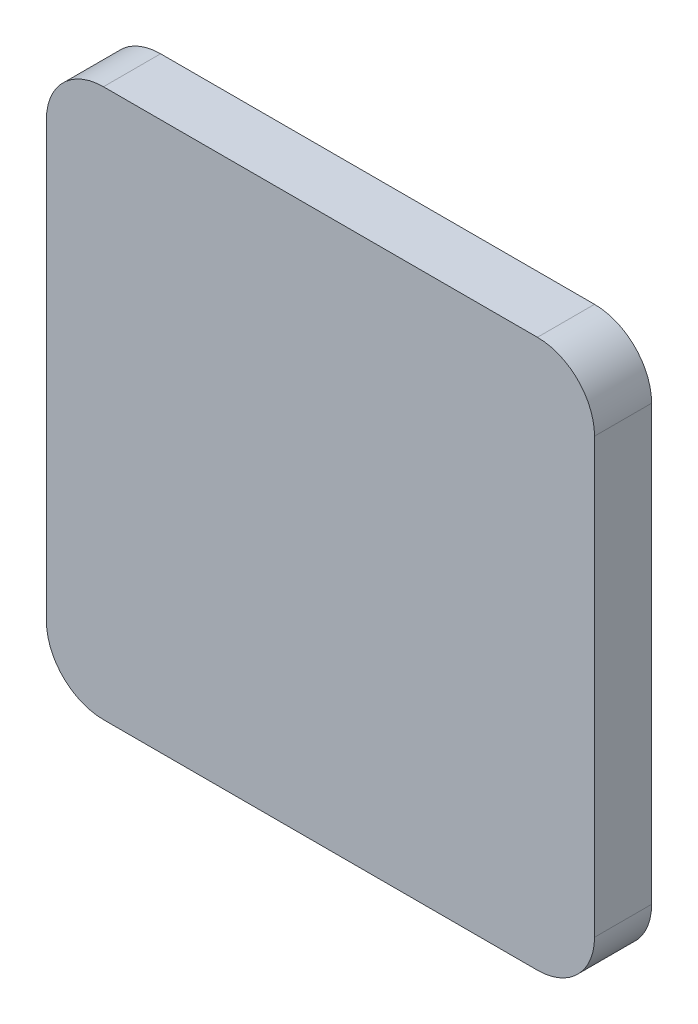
ISO-10303-21;
HEADER;
FILE_DESCRIPTION(('STEP AP214'),'2;1');
FILE_NAME('part.step','',(''),(''),'','','');
FILE_SCHEMA(('AUTOMOTIVE_DESIGN { 1 0 10303 214 1 1 1 1 }'));
ENDSEC;
DATA;
#1=APPLICATION_CONTEXT('core data for automotive mechanical design processes');
#2=APPLICATION_PROTOCOL_DEFINITION('international standard','automotive_design',2000,#1);
#3=PRODUCT_CONTEXT('',#1,'mechanical');
#4=PRODUCT('Part','Part','',(#3));
#5=PRODUCT_RELATED_PRODUCT_CATEGORY('part','',(#4));
#6=PRODUCT_DEFINITION_FORMATION('','',#4);
#7=PRODUCT_DEFINITION_CONTEXT('part definition',#1,'design');
#8=PRODUCT_DEFINITION('design','',#6,#7);
#9=PRODUCT_DEFINITION_SHAPE('','',#8);
#10=(LENGTH_UNIT() NAMED_UNIT(*) SI_UNIT(.MILLI.,.METRE.));
#11=(NAMED_UNIT(*) PLANE_ANGLE_UNIT() SI_UNIT($,.RADIAN.));
#12=(NAMED_UNIT(*) SI_UNIT($,.STERADIAN.) SOLID_ANGLE_UNIT());
#13=UNCERTAINTY_MEASURE_WITH_UNIT(LENGTH_MEASURE(1.E-05),#10,'distance_accuracy_value','');
#14=(GEOMETRIC_REPRESENTATION_CONTEXT(3) GLOBAL_UNCERTAINTY_ASSIGNED_CONTEXT((#13)) GLOBAL_UNIT_ASSIGNED_CONTEXT((#10,
#11,#12)) REPRESENTATION_CONTEXT('',''));
#15=CARTESIAN_POINT('',(0.,0.,0.));
#16=DIRECTION('',(0.,0.,1.));
#17=DIRECTION('',(1.,0.,0.));
#18=AXIS2_PLACEMENT_3D('',#15,#16,#17);
#19=CARTESIAN_POINT('',(3674.88097263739,-2.,10.));
#20=DIRECTION('',(0.,0.,-1.));
#21=DIRECTION('',(-1.,0.,0.));
#22=AXIS2_PLACEMENT_3D('',#19,#20,#21);
#23=CYLINDRICAL_SURFACE('',#22,9.99999999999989);
#24=CARTESIAN_POINT('',(3674.88097263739,-2.,0.));
#25=DIRECTION('',(0.,0.,1.));
#26=DIRECTION('',(1.,0.,0.));
#27=AXIS2_PLACEMENT_3D('',#24,#25,#26);
#28=CIRCLE('',#27,9.99999999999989);
#29=CARTESIAN_POINT('',(3684.88097263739,-2.00000000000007,0.));
#30=VERTEX_POINT('',#29);
#31=CARTESIAN_POINT('',(3674.88097263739,8.,0.));
#32=VERTEX_POINT('',#31);
#33=EDGE_CURVE('E92',#30,#32,#28,.T.);
#34=ORIENTED_EDGE('',*,*,#33,.T.);
#35=DIRECTION('',(0.,0.,-1.));
#36=VECTOR('',#35,1.);
#37=CARTESIAN_POINT('',(3674.88097263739,8.,10.));
#38=LINE('',#37,#36);
#39=CARTESIAN_POINT('',(3674.88097263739,8.,10.));
#40=VERTEX_POINT('',#39);
#41=EDGE_CURVE('E11',#40,#32,#38,.T.);
#42=ORIENTED_EDGE('',*,*,#41,.F.);
#43=CARTESIAN_POINT('',(3674.88097263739,-2.,10.));
#44=DIRECTION('',(0.,0.,1.));
#45=DIRECTION('',(1.,0.,0.));
#46=AXIS2_PLACEMENT_3D('',#43,#44,#45);
#47=CIRCLE('',#46,9.99999999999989);
#48=CARTESIAN_POINT('',(3684.88097263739,-2.00000000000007,10.));
#49=VERTEX_POINT('',#48);
#50=EDGE_CURVE('E119',#49,#40,#47,.T.);
#51=ORIENTED_EDGE('',*,*,#50,.F.);
#52=DIRECTION('',(0.,0.,-1.));
#53=VECTOR('',#52,1.);
#54=CARTESIAN_POINT('',(3684.88097263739,-2.00000000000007,10.));
#55=LINE('',#54,#53);
#56=EDGE_CURVE('E105',#49,#30,#55,.T.);
#57=ORIENTED_EDGE('',*,*,#56,.T.);
#58=EDGE_LOOP('',(#34,#42,#51,#57));
#59=FACE_BOUND('',#58,.T.);
#60=ADVANCED_FACE('F24',(#59),#23,.T.);
#61=CARTESIAN_POINT('',(3598.88097263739,8.,10.));
#62=DIRECTION('',(0.,-1.,0.));
#63=DIRECTION('',(0.,0.,-1.));
#64=AXIS2_PLACEMENT_3D('',#61,#62,#63);
#65=PLANE('',#64);
#66=DIRECTION('',(-1.,0.,0.));
#67=VECTOR('',#66,1.);
#68=CARTESIAN_POINT('',(3598.88097263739,8.,0.));
#69=LINE('',#68,#67);
#70=CARTESIAN_POINT('',(3598.88097263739,7.99999999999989,0.));
#71=VERTEX_POINT('',#70);
#72=EDGE_CURVE('E88',#32,#71,#69,.T.);
#73=ORIENTED_EDGE('',*,*,#72,.T.);
#74=DIRECTION('',(0.,0.,-1.));
#75=VECTOR('',#74,1.);
#76=CARTESIAN_POINT('',(3598.88097263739,7.99999999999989,10.));
#77=LINE('',#76,#75);
#78=CARTESIAN_POINT('',(3598.88097263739,7.99999999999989,10.));
#79=VERTEX_POINT('',#78);
#80=EDGE_CURVE('E31',#79,#71,#77,.T.);
#81=ORIENTED_EDGE('',*,*,#80,.F.);
#82=DIRECTION('',(-1.,0.,0.));
#83=VECTOR('',#82,1.);
#84=CARTESIAN_POINT('',(3598.88097263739,8.,10.));
#85=LINE('',#84,#83);
#86=EDGE_CURVE('E101',#40,#79,#85,.T.);
#87=ORIENTED_EDGE('',*,*,#86,.F.);
#88=ORIENTED_EDGE('',*,*,#41,.T.);
#89=EDGE_LOOP('',(#73,#81,#87,#88));
#90=FACE_BOUND('',#89,.T.);
#91=ADVANCED_FACE('F100',(#90),#65,.F.);
#92=CARTESIAN_POINT('',(3598.88097263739,-2.,10.));
#93=DIRECTION('',(0.,0.,-1.));
#94=DIRECTION('',(-1.,0.,0.));
#95=AXIS2_PLACEMENT_3D('',#92,#93,#94);
#96=CYLINDRICAL_SURFACE('',#95,9.9999999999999);
#97=CARTESIAN_POINT('',(3598.88097263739,-2.,0.));
#98=DIRECTION('',(0.,0.,1.));
#99=DIRECTION('',(-1.,0.,0.));
#100=AXIS2_PLACEMENT_3D('',#97,#98,#99);
#101=CIRCLE('',#100,9.9999999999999);
#102=CARTESIAN_POINT('',(3588.88097263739,-2.00000000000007,0.));
#103=VERTEX_POINT('',#102);
#104=EDGE_CURVE('E94',#71,#103,#101,.T.);
#105=ORIENTED_EDGE('',*,*,#104,.T.);
#106=DIRECTION('',(0.,0.,-1.));
#107=VECTOR('',#106,1.);
#108=CARTESIAN_POINT('',(3588.88097263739,-2.00000000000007,10.));
#109=LINE('',#108,#107);
#110=CARTESIAN_POINT('',(3588.88097263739,-2.00000000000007,10.));
#111=VERTEX_POINT('',#110);
#112=EDGE_CURVE('E145',#111,#103,#109,.T.);
#113=ORIENTED_EDGE('',*,*,#112,.F.);
#114=CARTESIAN_POINT('',(3598.88097263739,-2.,10.));
#115=DIRECTION('',(0.,0.,1.));
#116=DIRECTION('',(-1.,0.,0.));
#117=AXIS2_PLACEMENT_3D('',#114,#115,#116);
#118=CIRCLE('',#117,9.9999999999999);
#119=EDGE_CURVE('E122',#79,#111,#118,.T.);
#120=ORIENTED_EDGE('',*,*,#119,.F.);
#121=ORIENTED_EDGE('',*,*,#80,.T.);
#122=EDGE_LOOP('',(#105,#113,#120,#121));
#123=FACE_BOUND('',#122,.T.);
#124=ADVANCED_FACE('F149',(#123),#96,.T.);
#125=CARTESIAN_POINT('',(3588.88097263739,-2.00000000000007,10.));
#126=DIRECTION('',(1.,0.,0.));
#127=DIRECTION('',(0.,0.,-1.));
#128=AXIS2_PLACEMENT_3D('',#125,#126,#127);
#129=PLANE('',#128);
#130=DIRECTION('',(0.,-1.,0.));
#131=VECTOR('',#130,1.);
#132=CARTESIAN_POINT('',(3588.88097263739,-2.00000000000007,0.));
#133=LINE('',#132,#131);
#134=CARTESIAN_POINT('',(3588.88097263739,-77.9999999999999,0.));
#135=VERTEX_POINT('',#134);
#136=EDGE_CURVE('E109',#103,#135,#133,.T.);
#137=ORIENTED_EDGE('',*,*,#136,.T.);
#138=DIRECTION('',(0.,0.,-1.));
#139=VECTOR('',#138,1.);
#140=CARTESIAN_POINT('',(3588.88097263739,-77.9999999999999,10.));
#141=LINE('',#140,#139);
#142=CARTESIAN_POINT('',(3588.88097263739,-77.9999999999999,10.));
#143=VERTEX_POINT('',#142);
#144=EDGE_CURVE('E142',#143,#135,#141,.T.);
#145=ORIENTED_EDGE('',*,*,#144,.F.);
#146=DIRECTION('',(0.,-1.,0.));
#147=VECTOR('',#146,1.);
#148=CARTESIAN_POINT('',(3588.88097263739,-2.00000000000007,10.));
#149=LINE('',#148,#147);
#150=EDGE_CURVE('E124',#111,#143,#149,.T.);
#151=ORIENTED_EDGE('',*,*,#150,.F.);
#152=ORIENTED_EDGE('',*,*,#112,.T.);
#153=EDGE_LOOP('',(#137,#145,#151,#152));
#154=FACE_BOUND('',#153,.T.);
#155=ADVANCED_FACE('F157',(#154),#129,.F.);
#156=CARTESIAN_POINT('',(3598.88097263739,-78.,10.));
#157=DIRECTION('',(0.,0.,-1.));
#158=DIRECTION('',(-1.,0.,0.));
#159=AXIS2_PLACEMENT_3D('',#156,#157,#158);
#160=CYLINDRICAL_SURFACE('',#159,9.99999999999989);
#161=CARTESIAN_POINT('',(3598.88097263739,-78.,0.));
#162=DIRECTION('',(0.,0.,1.));
#163=DIRECTION('',(-1.,0.,0.));
#164=AXIS2_PLACEMENT_3D('',#161,#162,#163);
#165=CIRCLE('',#164,9.99999999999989);
#166=CARTESIAN_POINT('',(3598.88097263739,-88.,0.));
#167=VERTEX_POINT('',#166);
#168=EDGE_CURVE('E111',#135,#167,#165,.T.);
#169=ORIENTED_EDGE('',*,*,#168,.T.);
#170=DIRECTION('',(0.,0.,-1.));
#171=VECTOR('',#170,1.);
#172=CARTESIAN_POINT('',(3598.88097263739,-88.,10.));
#173=LINE('',#172,#171);
#174=CARTESIAN_POINT('',(3598.88097263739,-88.,10.));
#175=VERTEX_POINT('',#174);
#176=EDGE_CURVE('E139',#175,#167,#173,.T.);
#177=ORIENTED_EDGE('',*,*,#176,.F.);
#178=CARTESIAN_POINT('',(3598.88097263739,-78.,10.));
#179=DIRECTION('',(0.,0.,1.));
#180=DIRECTION('',(-1.,0.,0.));
#181=AXIS2_PLACEMENT_3D('',#178,#179,#180);
#182=CIRCLE('',#181,9.99999999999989);
#183=EDGE_CURVE('E126',#143,#175,#182,.T.);
#184=ORIENTED_EDGE('',*,*,#183,.F.);
#185=ORIENTED_EDGE('',*,*,#144,.T.);
#186=EDGE_LOOP('',(#169,#177,#184,#185));
#187=FACE_BOUND('',#186,.T.);
#188=ADVANCED_FACE('F160',(#187),#160,.T.);
#189=CARTESIAN_POINT('',(3598.88097263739,-88.,10.));
#190=DIRECTION('',(0.,1.,0.));
#191=DIRECTION('',(0.,0.,1.));
#192=AXIS2_PLACEMENT_3D('',#189,#190,#191);
#193=PLANE('',#192);
#194=DIRECTION('',(1.,0.,0.));
#195=VECTOR('',#194,1.);
#196=CARTESIAN_POINT('',(3598.88097263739,-88.,0.));
#197=LINE('',#196,#195);
#198=CARTESIAN_POINT('',(3674.88097263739,-87.9999999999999,0.));
#199=VERTEX_POINT('',#198);
#200=EDGE_CURVE('E113',#167,#199,#197,.T.);
#201=ORIENTED_EDGE('',*,*,#200,.T.);
#202=DIRECTION('',(0.,0.,-1.));
#203=VECTOR('',#202,1.);
#204=CARTESIAN_POINT('',(3674.88097263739,-87.9999999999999,10.));
#205=LINE('',#204,#203);
#206=CARTESIAN_POINT('',(3674.88097263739,-87.9999999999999,10.));
#207=VERTEX_POINT('',#206);
#208=EDGE_CURVE('E136',#207,#199,#205,.T.);
#209=ORIENTED_EDGE('',*,*,#208,.F.);
#210=DIRECTION('',(1.,0.,0.));
#211=VECTOR('',#210,1.);
#212=CARTESIAN_POINT('',(3598.88097263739,-88.,10.));
#213=LINE('',#212,#211);
#214=EDGE_CURVE('E128',#175,#207,#213,.T.);
#215=ORIENTED_EDGE('',*,*,#214,.F.);
#216=ORIENTED_EDGE('',*,*,#176,.T.);
#217=EDGE_LOOP('',(#201,#209,#215,#216));
#218=FACE_BOUND('',#217,.T.);
#219=ADVANCED_FACE('F165',(#218),#193,.F.);
#220=CARTESIAN_POINT('',(3674.88097263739,-78.,10.));
#221=DIRECTION('',(0.,0.,-1.));
#222=DIRECTION('',(-1.,0.,0.));
#223=AXIS2_PLACEMENT_3D('',#220,#221,#222);
#224=CYLINDRICAL_SURFACE('',#223,9.99999999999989);
#225=CARTESIAN_POINT('',(3674.88097263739,-78.,0.));
#226=DIRECTION('',(0.,0.,1.));
#227=DIRECTION('',(1.,0.,0.));
#228=AXIS2_PLACEMENT_3D('',#225,#226,#227);
#229=CIRCLE('',#228,9.99999999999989);
#230=CARTESIAN_POINT('',(3684.88097263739,-77.9999999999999,0.));
#231=VERTEX_POINT('',#230);
#232=EDGE_CURVE('E115',#199,#231,#229,.T.);
#233=ORIENTED_EDGE('',*,*,#232,.T.);
#234=DIRECTION('',(0.,0.,-1.));
#235=VECTOR('',#234,1.);
#236=CARTESIAN_POINT('',(3684.88097263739,-77.9999999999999,10.));
#237=LINE('',#236,#235);
#238=CARTESIAN_POINT('',(3684.88097263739,-77.9999999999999,10.));
#239=VERTEX_POINT('',#238);
#240=EDGE_CURVE('E133',#239,#231,#237,.T.);
#241=ORIENTED_EDGE('',*,*,#240,.F.);
#242=CARTESIAN_POINT('',(3674.88097263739,-78.,10.));
#243=DIRECTION('',(0.,0.,1.));
#244=DIRECTION('',(1.,0.,0.));
#245=AXIS2_PLACEMENT_3D('',#242,#243,#244);
#246=CIRCLE('',#245,9.99999999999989);
#247=EDGE_CURVE('E43',#207,#239,#246,.T.);
#248=ORIENTED_EDGE('',*,*,#247,.F.);
#249=ORIENTED_EDGE('',*,*,#208,.T.);
#250=EDGE_LOOP('',(#233,#241,#248,#249));
#251=FACE_BOUND('',#250,.T.);
#252=ADVANCED_FACE('F168',(#251),#224,.T.);
#253=CARTESIAN_POINT('',(3684.88097263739,-2.00000000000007,10.));
#254=DIRECTION('',(-1.,0.,0.));
#255=DIRECTION('',(0.,0.,1.));
#256=AXIS2_PLACEMENT_3D('',#253,#254,#255);
#257=PLANE('',#256);
#258=DIRECTION('',(0.,1.,0.));
#259=VECTOR('',#258,1.);
#260=CARTESIAN_POINT('',(3684.88097263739,-2.00000000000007,0.));
#261=LINE('',#260,#259);
#262=EDGE_CURVE('E117',#231,#30,#261,.T.);
#263=ORIENTED_EDGE('',*,*,#262,.T.);
#264=ORIENTED_EDGE('',*,*,#56,.F.);
#265=DIRECTION('',(0.,1.,0.));
#266=VECTOR('',#265,1.);
#267=CARTESIAN_POINT('',(3684.88097263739,-2.00000000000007,10.));
#268=LINE('',#267,#266);
#269=EDGE_CURVE('E38',#239,#49,#268,.T.);
#270=ORIENTED_EDGE('',*,*,#269,.F.);
#271=ORIENTED_EDGE('',*,*,#240,.T.);
#272=EDGE_LOOP('',(#263,#264,#270,#271));
#273=FACE_BOUND('',#272,.T.);
#274=ADVANCED_FACE('F170',(#273),#257,.F.);
#275=CARTESIAN_POINT('',(3674.88097263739,-2.,10.));
#276=DIRECTION('',(0.,0.,1.));
#277=DIRECTION('',(1.,0.,0.));
#278=AXIS2_PLACEMENT_3D('',#275,#276,#277);
#279=PLANE('',#278);
#280=ORIENTED_EDGE('',*,*,#50,.T.);
#281=ORIENTED_EDGE('',*,*,#86,.T.);
#282=ORIENTED_EDGE('',*,*,#119,.T.);
#283=ORIENTED_EDGE('',*,*,#150,.T.);
#284=ORIENTED_EDGE('',*,*,#183,.T.);
#285=ORIENTED_EDGE('',*,*,#214,.T.);
#286=ORIENTED_EDGE('',*,*,#247,.T.);
#287=ORIENTED_EDGE('',*,*,#269,.T.);
#288=EDGE_LOOP('',(#280,#281,#282,#283,#284,#285,#286,#287));
#289=FACE_BOUND('',#288,.T.);
#290=ADVANCED_FACE('F152',(#289),#279,.T.);
#291=CARTESIAN_POINT('',(3674.88097263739,-2.,0.));
#292=DIRECTION('',(0.,0.,1.));
#293=DIRECTION('',(1.,0.,0.));
#294=AXIS2_PLACEMENT_3D('',#291,#292,#293);
#295=PLANE('',#294);
#296=ORIENTED_EDGE('',*,*,#33,.F.);
#297=ORIENTED_EDGE('',*,*,#262,.F.);
#298=ORIENTED_EDGE('',*,*,#232,.F.);
#299=ORIENTED_EDGE('',*,*,#200,.F.);
#300=ORIENTED_EDGE('',*,*,#168,.F.);
#301=ORIENTED_EDGE('',*,*,#136,.F.);
#302=ORIENTED_EDGE('',*,*,#104,.F.);
#303=ORIENTED_EDGE('',*,*,#72,.F.);
#304=EDGE_LOOP('',(#296,#297,#298,#299,#300,#301,#302,#303));
#305=FACE_BOUND('',#304,.T.);
#306=ADVANCED_FACE('F89',(#305),#295,.F.);
#307=CLOSED_SHELL('',(#60,#91,#124,#155,#188,#219,#252,#274,#290,#306));
#308=MANIFOLD_SOLID_BREP('B2',#307);
#309=ADVANCED_BREP_SHAPE_REPRESENTATION('',(#18,#308),#14);
#310=SHAPE_DEFINITION_REPRESENTATION(#9,#309);
ENDSEC;
END-ISO-10303-21;
